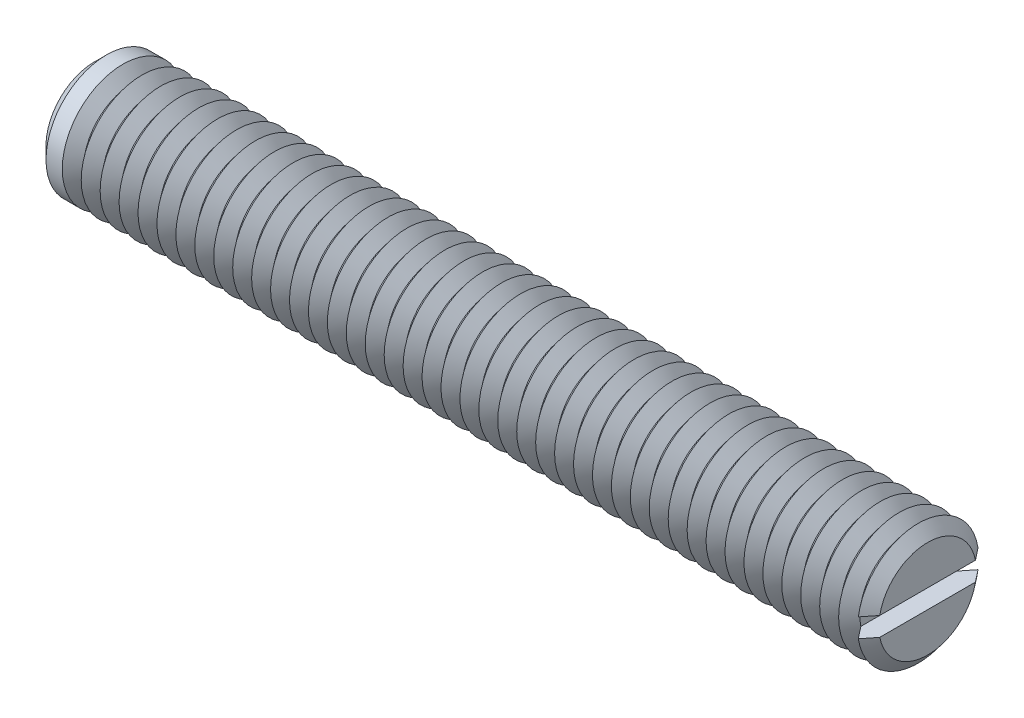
from build123d import *

# Parameters (mm, degrees)
SKETCH1_R       = 4
EXTRUDE1_DEPTH  = 27.5
SKETCH2_W       = 1.25
SKETCH2_H       = 1.25
EXTRUDE2_DEPTH  = 6
CHAMFER1_SIZE   = 0.8
LPATTERN1_COUNT = 43
LPATTERN1_PITCH = 1.25


with BuildPart() as part:
    # Sketch1 → Extrude1 (new, symmetric)
    with BuildSketch(Plane(origin=(0, 0, 0), x_dir=(0, 0, -1), z_dir=(1, 0, 0))):
        Circle(SKETCH1_R)
    extrude(amount=EXTRUDE1_DEPTH, both=True)

    # Sketch2 → Extrude2 (cut, symmetric)
    with BuildSketch(Plane.XY):
        with Locations((26.875, 0)):
            Rectangle(SKETCH2_W, SKETCH2_H)
    extrude(amount=EXTRUDE2_DEPTH, both=True, mode=Mode.SUBTRACT)

    # Chamfer1
    chamfer1_edges = [part.edges().sort_by_distance(p)[0] for p in [
        (-27.5, 0, 4),
    ]]
    chamfer(chamfer1_edges, length=CHAMFER1_SIZE)

    # Sketch3 → Cut-Revolve1 (revolve, cut)
    with BuildSketch(Plane.XY, mode=Mode.PRIVATE) as cut_revolve1_sk:
        Polygon((26.875, -4), (28.125, -4), (27.5, -3.21937525), align=None)
    cut_revolve1 = revolve(cut_revolve1_sk.sketch.rotate(Axis((0, 0, 0), (1, 0, 0)), 278.989299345), axis=Axis((0, 0, 0), (1, 0, 0)), mode=Mode.SUBTRACT)

    # LPattern1: Cut-Revolve1 ×43
    with Locations(*[(-i * LPATTERN1_PITCH, 0, 0) for i in range(1, LPATTERN1_COUNT)]):
        add(cut_revolve1, mode=Mode.SUBTRACT)


solid = part.part
